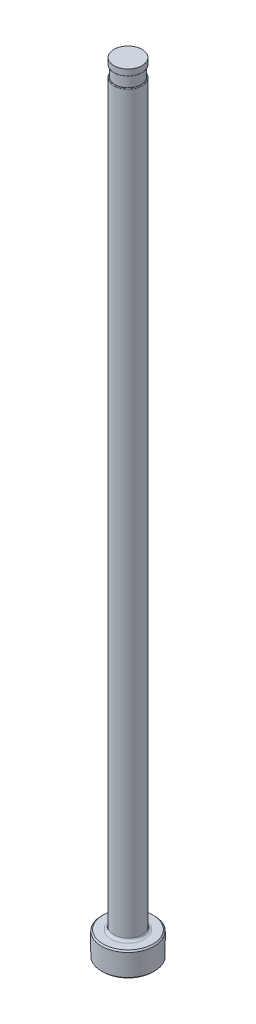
ISO-10303-21;
HEADER;
FILE_DESCRIPTION(('STEP AP214'),'2;1');
FILE_NAME('part.step','',(''),(''),'','','');
FILE_SCHEMA(('AUTOMOTIVE_DESIGN { 1 0 10303 214 1 1 1 1 }'));
ENDSEC;
DATA;
#1=APPLICATION_CONTEXT('core data for automotive mechanical design processes');
#2=APPLICATION_PROTOCOL_DEFINITION('international standard','automotive_design',2000,#1);
#3=PRODUCT_CONTEXT('',#1,'mechanical');
#4=PRODUCT('Part','Part','',(#3));
#5=PRODUCT_RELATED_PRODUCT_CATEGORY('part','',(#4));
#6=PRODUCT_DEFINITION_FORMATION('','',#4);
#7=PRODUCT_DEFINITION_CONTEXT('part definition',#1,'design');
#8=PRODUCT_DEFINITION('design','',#6,#7);
#9=PRODUCT_DEFINITION_SHAPE('','',#8);
#10=(LENGTH_UNIT() NAMED_UNIT(*) SI_UNIT(.MILLI.,.METRE.));
#11=(NAMED_UNIT(*) PLANE_ANGLE_UNIT() SI_UNIT($,.RADIAN.));
#12=(NAMED_UNIT(*) SI_UNIT($,.STERADIAN.) SOLID_ANGLE_UNIT());
#13=UNCERTAINTY_MEASURE_WITH_UNIT(LENGTH_MEASURE(1.E-05),#10,'distance_accuracy_value','');
#14=(GEOMETRIC_REPRESENTATION_CONTEXT(3) GLOBAL_UNCERTAINTY_ASSIGNED_CONTEXT((#13)) GLOBAL_UNIT_ASSIGNED_CONTEXT((#10,
#11,#12)) REPRESENTATION_CONTEXT('',''));
#15=CARTESIAN_POINT('',(0.,0.,0.));
#16=DIRECTION('',(0.,0.,1.));
#17=DIRECTION('',(1.,0.,0.));
#18=AXIS2_PLACEMENT_3D('',#15,#16,#17);
#19=CARTESIAN_POINT('',(-2.77748999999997,151.13,0.));
#20=DIRECTION('',(0.,1.,0.));
#21=DIRECTION('',(0.,0.,1.));
#22=AXIS2_PLACEMENT_3D('',#19,#20,#21);
#23=PLANE('',#22);
#24=CARTESIAN_POINT('',(0.,151.13,0.));
#25=DIRECTION('',(0.,1.,0.));
#26=DIRECTION('',(0.,0.,1.));
#27=AXIS2_PLACEMENT_3D('',#24,#25,#26);
#28=CIRCLE('',#27,2.63143999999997);
#29=CARTESIAN_POINT('',(0.,151.13,2.63143999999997));
#30=VERTEX_POINT('',#29);
#31=EDGE_CURVE('E11',#30,#30,#28,.F.);
#32=ORIENTED_EDGE('',*,*,#31,.T.);
#33=EDGE_LOOP('',(#32));
#34=FACE_BOUND('',#33,.T.);
#35=CARTESIAN_POINT('',(0.,151.13,0.));
#36=DIRECTION('',(0.,1.,0.));
#37=DIRECTION('',(0.,0.,1.));
#38=AXIS2_PLACEMENT_3D('',#35,#36,#37);
#39=CIRCLE('',#38,2.57428999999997);
#40=CARTESIAN_POINT('',(0.,151.13,2.57428999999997));
#41=VERTEX_POINT('',#40);
#42=EDGE_CURVE('E78',#41,#41,#39,.T.);
#43=ORIENTED_EDGE('',*,*,#42,.T.);
#44=EDGE_LOOP('',(#43));
#45=FACE_BOUND('',#44,.T.);
#46=ADVANCED_FACE('F36',(#34,#45),#23,.F.);
#47=CARTESIAN_POINT('',(0.,259.958771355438,0.));
#48=DIRECTION('',(0.,1.,0.));
#49=DIRECTION('',(0.,0.,1.));
#50=AXIS2_PLACEMENT_3D('',#47,#48,#49);
#51=CYLINDRICAL_SURFACE('',#50,2.77748999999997);
#52=DIRECTION('',(0.,1.,0.));
#53=VECTOR('',#52,1.);
#54=CARTESIAN_POINT('',(-2.57428999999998,259.958771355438,-1.04282390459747));
#55=LINE('',#54,#53);
#56=CARTESIAN_POINT('',(-2.57428999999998,148.971,-1.04282390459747));
#57=VERTEX_POINT('',#56);
#58=CARTESIAN_POINT('',(-2.57428999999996,86.614,-1.04282390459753));
#59=VERTEX_POINT('',#58);
#60=EDGE_CURVE('E73',#57,#59,#55,.F.);
#61=ORIENTED_EDGE('',*,*,#60,.F.);
#62=CARTESIAN_POINT('',(0.,148.971,0.));
#63=DIRECTION('',(0.,-1.,0.));
#64=DIRECTION('',(0.,0.,-1.));
#65=AXIS2_PLACEMENT_3D('',#62,#63,#64);
#66=CIRCLE('',#65,2.77748999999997);
#67=CARTESIAN_POINT('',(-2.57428999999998,148.971,1.04282390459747));
#68=VERTEX_POINT('',#67);
#69=EDGE_CURVE('E51',#57,#68,#66,.T.);
#70=ORIENTED_EDGE('',*,*,#69,.T.);
#71=DIRECTION('',(0.,1.,0.));
#72=VECTOR('',#71,1.);
#73=CARTESIAN_POINT('',(-2.57428999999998,259.958771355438,1.04282390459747));
#74=LINE('',#73,#72);
#75=CARTESIAN_POINT('',(-2.57428999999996,86.614,1.04282390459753));
#76=VERTEX_POINT('',#75);
#77=EDGE_CURVE('E84',#76,#68,#74,.T.);
#78=ORIENTED_EDGE('',*,*,#77,.F.);
#79=CARTESIAN_POINT('',(-2.57428999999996,86.614,-1.04282390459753));
#80=CARTESIAN_POINT('',(-2.57428787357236,86.5815852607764,-1.04282111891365));
#81=CARTESIAN_POINT('',(-2.57478701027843,86.5491850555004,-1.04159798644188));
#82=CARTESIAN_POINT('',(-2.57676382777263,86.4845964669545,-1.03670102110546));
#83=CARTESIAN_POINT('',(-2.57824163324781,86.4524081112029,-1.03302687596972));
#84=CARTESIAN_POINT('',(-2.58411032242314,86.356391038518,-1.01830472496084));
#85=CARTESIAN_POINT('',(-2.58993639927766,86.2931681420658,-1.00355696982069));
#86=CARTESIAN_POINT('',(-2.60484835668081,86.1701975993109,-0.964186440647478));
#87=CARTESIAN_POINT('',(-2.61393879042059,86.1104549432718,-0.939549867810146));
#88=CARTESIAN_POINT('',(-2.63439257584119,85.9964330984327,-0.880565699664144));
#89=CARTESIAN_POINT('',(-2.64575368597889,85.9421486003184,-0.846227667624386));
#90=CARTESIAN_POINT('',(-2.66906948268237,85.8423648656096,-0.769463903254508));
#91=CARTESIAN_POINT('',(-2.68099701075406,85.796654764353,-0.727304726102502));
#92=CARTESIAN_POINT('',(-2.70429977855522,85.7137106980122,-0.635186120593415));
#93=CARTESIAN_POINT('',(-2.71567511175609,85.676475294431,-0.585228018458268));
#94=CARTESIAN_POINT('',(-2.73569711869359,85.6140565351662,-0.482647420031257));
#95=CARTESIAN_POINT('',(-2.74447837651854,85.5882160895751,-0.430450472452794));
#96=CARTESIAN_POINT('',(-2.75929586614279,85.5457915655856,-0.322059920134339));
#97=CARTESIAN_POINT('',(-2.76533294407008,85.5292046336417,-0.265867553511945));
#98=CARTESIAN_POINT('',(-2.77376309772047,85.5062965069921,-0.153923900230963));
#99=CARTESIAN_POINT('',(-2.77631330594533,85.4995317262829,-0.0982747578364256));
#100=CARTESIAN_POINT('',(-2.77801884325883,85.4949917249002,0.0134385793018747));
#101=CARTESIAN_POINT('',(-2.77717458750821,85.497215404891,0.0695027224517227));
#102=CARTESIAN_POINT('',(-2.7722209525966,85.5104908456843,0.179520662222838));
#103=CARTESIAN_POINT('',(-2.76816343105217,85.5214024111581,0.233493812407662));
#104=CARTESIAN_POINT('',(-2.75726458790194,85.5516137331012,0.33873691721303));
#105=CARTESIAN_POINT('',(-2.7504233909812,85.5709131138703,0.390006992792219));
#106=CARTESIAN_POINT('',(-2.73459621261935,85.617579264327,0.488834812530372));
#107=CARTESIAN_POINT('',(-2.7255949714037,85.6450037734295,0.536362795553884));
#108=CARTESIAN_POINT('',(-2.70638807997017,85.7071227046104,0.626118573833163));
#109=CARTESIAN_POINT('',(-2.69618232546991,85.741817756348,0.668345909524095));
#110=CARTESIAN_POINT('',(-2.67522940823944,85.8187559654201,0.747895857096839));
#111=CARTESIAN_POINT('',(-2.66447542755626,85.8612077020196,0.785014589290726));
#112=CARTESIAN_POINT('',(-2.64380227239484,85.9516395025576,0.852053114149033));
#113=CARTESIAN_POINT('',(-2.63388340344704,85.9996215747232,0.881970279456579));
#114=CARTESIAN_POINT('',(-2.61524736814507,86.1028148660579,0.935839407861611));
#115=CARTESIAN_POINT('',(-2.60663744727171,86.1582867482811,0.959328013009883));
#116=CARTESIAN_POINT('',(-2.5921893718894,86.2724618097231,0.997711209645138));
#117=CARTESIAN_POINT('',(-2.58635078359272,86.3311644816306,1.01260714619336));
#118=CARTESIAN_POINT('',(-2.57955503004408,86.4275266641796,1.02975451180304));
#119=CARTESIAN_POINT('',(-2.57758531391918,86.4646676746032,1.03466198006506));
#120=CARTESIAN_POINT('',(-2.57495138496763,86.5392020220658,1.04119168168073));
#121=CARTESIAN_POINT('',(-2.57428434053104,86.5765946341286,1.04282104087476));
#122=CARTESIAN_POINT('',(-2.57428999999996,86.614,1.04282390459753));
#123=B_SPLINE_CURVE_WITH_KNOTS('',3,(#79,#80,#81,#82,#83,#84,#85,#86,#87,#88,#89,#90,#91,#92,
#93,#94,#95,#96,#97,#98,#99,#100,#101,#102,#103,#104,#105,#106,#107,#108,#109,#110,#111,#112,
#113,#114,#115,#116,#117,#118,#119,#120,#121,#122),.UNSPECIFIED.,.F.,.F.,(4,2,2,2,2,2,2,2,2,2,2,
2,2,2,2,2,2,2,2,2,2,4),(0.,0.0971880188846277,0.194388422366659,0.388960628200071,
0.583805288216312,0.778458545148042,0.967406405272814,1.1563221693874,1.33212671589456,
1.50787701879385,1.67541271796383,1.84292792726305,2.00779344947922,2.17265158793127,
2.33871056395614,2.5047839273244,2.67625192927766,2.84778239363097,3.02956415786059,
3.21131745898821,3.32371085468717,3.43585966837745),.UNSPECIFIED.);
#124=EDGE_CURVE('E81',#59,#76,#123,.T.);
#125=ORIENTED_EDGE('',*,*,#124,.F.);
#126=EDGE_LOOP('',(#61,#70,#78,#125));
#127=FACE_BOUND('',#126,.T.);
#128=CARTESIAN_POINT('',(0.,5.25779999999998,0.));
#129=DIRECTION('',(0.,1.,0.));
#130=DIRECTION('',(0.,0.,1.));
#131=AXIS2_PLACEMENT_3D('',#128,#129,#130);
#132=CIRCLE('',#131,2.77748999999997);
#133=CARTESIAN_POINT('',(0.,5.25779999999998,2.77748999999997));
#134=VERTEX_POINT('',#133);
#135=EDGE_CURVE('E116',#134,#134,#132,.T.);
#136=ORIENTED_EDGE('',*,*,#135,.T.);
#137=EDGE_LOOP('',(#136));
#138=FACE_BOUND('',#137,.T.);
#139=ADVANCED_FACE('F82',(#127,#138),#51,.T.);
#140=CARTESIAN_POINT('',(0.,0.,0.));
#141=DIRECTION('',(0.,-1.,0.));
#142=DIRECTION('',(0.,0.,-1.));
#143=AXIS2_PLACEMENT_3D('',#140,#141,#142);
#144=PLANE('',#143);
#145=CARTESIAN_POINT('',(0.,0.,0.));
#146=DIRECTION('',(0.,-1.,0.));
#147=DIRECTION('',(0.,0.,-1.));
#148=AXIS2_PLACEMENT_3D('',#145,#146,#147);
#149=CIRCLE('',#148,4.90220000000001);
#150=CARTESIAN_POINT('',(0.,0.,-4.90220000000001));
#151=VERTEX_POINT('',#150);
#152=EDGE_CURVE('E113',#151,#151,#149,.T.);
#153=ORIENTED_EDGE('',*,*,#152,.T.);
#154=EDGE_LOOP('',(#153));
#155=FACE_BOUND('',#154,.T.);
#156=ADVANCED_FACE('F192',(#155),#144,.T.);
#157=CARTESIAN_POINT('',(0.,259.958771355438,0.));
#158=DIRECTION('',(0.,1.,0.));
#159=DIRECTION('',(0.,0.,1.));
#160=AXIS2_PLACEMENT_3D('',#157,#158,#159);
#161=CYLINDRICAL_SURFACE('',#160,5.15619999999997);
#162=CARTESIAN_POINT('',(0.,4.49580000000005,0.));
#163=DIRECTION('',(0.,1.,0.));
#164=DIRECTION('',(0.,0.,1.));
#165=AXIS2_PLACEMENT_3D('',#162,#163,#164);
#166=CIRCLE('',#165,5.15619999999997);
#167=CARTESIAN_POINT('',(0.,4.49580000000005,5.15619999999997));
#168=VERTEX_POINT('',#167);
#169=EDGE_CURVE('E110',#168,#168,#166,.F.);
#170=ORIENTED_EDGE('',*,*,#169,.T.);
#171=EDGE_LOOP('',(#170));
#172=FACE_BOUND('',#171,.T.);
#173=CARTESIAN_POINT('',(0.,0.253999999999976,0.));
#174=DIRECTION('',(0.,-1.,0.));
#175=DIRECTION('',(0.,0.,-1.));
#176=AXIS2_PLACEMENT_3D('',#173,#174,#175);
#177=CIRCLE('',#176,5.15619999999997);
#178=CARTESIAN_POINT('',(0.,0.253999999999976,-5.15619999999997));
#179=VERTEX_POINT('',#178);
#180=EDGE_CURVE('E107',#179,#179,#177,.F.);
#181=ORIENTED_EDGE('',*,*,#180,.T.);
#182=EDGE_LOOP('',(#181));
#183=FACE_BOUND('',#182,.T.);
#184=ADVANCED_FACE('F195',(#172,#183),#161,.T.);
#185=CARTESIAN_POINT('',(-5.15619999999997,4.7498,0.));
#186=DIRECTION('',(0.,1.,0.));
#187=DIRECTION('',(0.,0.,1.));
#188=AXIS2_PLACEMENT_3D('',#185,#186,#187);
#189=PLANE('',#188);
#190=CARTESIAN_POINT('',(0.,4.7498,0.));
#191=DIRECTION('',(0.,1.,0.));
#192=DIRECTION('',(0.,0.,1.));
#193=AXIS2_PLACEMENT_3D('',#190,#191,#192);
#194=CIRCLE('',#193,3.28548999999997);
#195=CARTESIAN_POINT('',(0.,4.7498,3.28548999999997));
#196=VERTEX_POINT('',#195);
#197=EDGE_CURVE('E87',#196,#196,#194,.F.);
#198=ORIENTED_EDGE('',*,*,#197,.T.);
#199=EDGE_LOOP('',(#198));
#200=FACE_BOUND('',#199,.T.);
#201=CARTESIAN_POINT('',(0.,4.7498,0.));
#202=DIRECTION('',(0.,1.,0.));
#203=DIRECTION('',(0.,0.,1.));
#204=AXIS2_PLACEMENT_3D('',#201,#202,#203);
#205=CIRCLE('',#204,4.90220000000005);
#206=CARTESIAN_POINT('',(0.,4.7498,4.90220000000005));
#207=VERTEX_POINT('',#206);
#208=EDGE_CURVE('E104',#207,#207,#205,.T.);
#209=ORIENTED_EDGE('',*,*,#208,.T.);
#210=EDGE_LOOP('',(#209));
#211=FACE_BOUND('',#210,.T.);
#212=ADVANCED_FACE('F190',(#200,#211),#189,.T.);
#213=CARTESIAN_POINT('',(0.,4.74980000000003,0.));
#214=DIRECTION('',(0.,-1.,0.));
#215=DIRECTION('',(0.,0.,-1.));
#216=AXIS2_PLACEMENT_3D('',#213,#214,#215);
#217=CONICAL_SURFACE('',#216,4.90220000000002,0.785398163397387);
#218=ORIENTED_EDGE('',*,*,#169,.F.);
#219=EDGE_LOOP('',(#218));
#220=FACE_BOUND('',#219,.T.);
#221=ORIENTED_EDGE('',*,*,#208,.F.);
#222=EDGE_LOOP('',(#221));
#223=FACE_BOUND('',#222,.T.);
#224=ADVANCED_FACE('F186',(#220,#223),#217,.T.);
#225=CARTESIAN_POINT('',(0.,0.253999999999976,0.));
#226=DIRECTION('',(0.,1.,0.));
#227=DIRECTION('',(0.,0.,1.));
#228=AXIS2_PLACEMENT_3D('',#225,#226,#227);
#229=CONICAL_SURFACE('',#228,5.15619999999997,0.785398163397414);
#230=ORIENTED_EDGE('',*,*,#152,.F.);
#231=EDGE_LOOP('',(#230));
#232=FACE_BOUND('',#231,.T.);
#233=ORIENTED_EDGE('',*,*,#180,.F.);
#234=EDGE_LOOP('',(#233));
#235=FACE_BOUND('',#234,.T.);
#236=ADVANCED_FACE('F182',(#232,#235),#229,.T.);
#237=CARTESIAN_POINT('',(0.,5.25779999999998,0.));
#238=DIRECTION('',(0.,1.,0.));
#239=DIRECTION('',(0.,0.,1.));
#240=AXIS2_PLACEMENT_3D('',#237,#238,#239);
#241=TOROIDAL_SURFACE('',#240,3.28548999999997,0.508);
#242=ORIENTED_EDGE('',*,*,#197,.F.);
#243=EDGE_LOOP('',(#242));
#244=FACE_BOUND('',#243,.T.);
#245=ORIENTED_EDGE('',*,*,#135,.F.);
#246=EDGE_LOOP('',(#245));
#247=FACE_BOUND('',#246,.T.);
#248=ADVANCED_FACE('F147',(#244,#247),#241,.F.);
#249=CARTESIAN_POINT('',(-2.77748999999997,149.098,0.));
#250=DIRECTION('',(0.,-1.,0.));
#251=DIRECTION('',(0.,0.,-1.));
#252=AXIS2_PLACEMENT_3D('',#249,#250,#251);
#253=PLANE('',#252);
#254=DIRECTION('',(0.,0.,1.));
#255=VECTOR('',#254,1.);
#256=CARTESIAN_POINT('',(-2.57428999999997,149.098,0.));
#257=LINE('',#256,#255);
#258=CARTESIAN_POINT('',(-2.57428999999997,149.098,0.));
#259=VERTEX_POINT('',#258);
#260=CARTESIAN_POINT('',(-2.57428999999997,149.098,0.630974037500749));
#261=VERTEX_POINT('',#260);
#262=EDGE_CURVE('E90',#259,#261,#257,.T.);
#263=ORIENTED_EDGE('',*,*,#262,.T.);
#264=CARTESIAN_POINT('',(0.,149.098,0.));
#265=DIRECTION('',(0.,-1.,0.));
#266=DIRECTION('',(0.,0.,-1.));
#267=AXIS2_PLACEMENT_3D('',#264,#265,#266);
#268=CIRCLE('',#267,2.65048999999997);
#269=CARTESIAN_POINT('',(-2.57428999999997,149.098,-0.630974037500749));
#270=VERTEX_POINT('',#269);
#271=EDGE_CURVE('E86',#261,#270,#268,.F.);
#272=ORIENTED_EDGE('',*,*,#271,.T.);
#273=EDGE_CURVE('E79',#270,#259,#257,.T.);
#274=ORIENTED_EDGE('',*,*,#273,.T.);
#275=CARTESIAN_POINT('',(0.,149.098,0.));
#276=DIRECTION('',(0.,1.,0.));
#277=DIRECTION('',(0.,0.,1.));
#278=AXIS2_PLACEMENT_3D('',#275,#276,#277);
#279=CIRCLE('',#278,2.57428999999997);
#280=EDGE_CURVE('E101',#259,#259,#279,.T.);
#281=ORIENTED_EDGE('',*,*,#280,.F.);
#282=EDGE_LOOP('',(#263,#272,#274,#281));
#283=FACE_BOUND('',#282,.T.);
#284=ADVANCED_FACE('F144',(#283),#253,.F.);
#285=CARTESIAN_POINT('',(0.,153.448281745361,0.));
#286=DIRECTION('',(0.,1.,0.));
#287=DIRECTION('',(0.,0.,1.));
#288=AXIS2_PLACEMENT_3D('',#285,#286,#287);
#289=CYLINDRICAL_SURFACE('',#288,2.57428999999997);
#290=ORIENTED_EDGE('',*,*,#42,.F.);
#291=EDGE_LOOP('',(#290));
#292=FACE_BOUND('',#291,.T.);
#293=ORIENTED_EDGE('',*,*,#280,.T.);
#294=EDGE_LOOP('',(#293));
#295=FACE_BOUND('',#294,.T.);
#296=ADVANCED_FACE('F141',(#292,#295),#289,.T.);
#297=CARTESIAN_POINT('',(-2.57428999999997,150.114,-5.15619999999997));
#298=DIRECTION('',(1.,0.,0.));
#299=DIRECTION('',(0.,1.,0.));
#300=AXIS2_PLACEMENT_3D('',#297,#298,#299);
#301=PLANE('',#300);
#302=ORIENTED_EDGE('',*,*,#273,.F.);
#303=CARTESIAN_POINT('',(-2.57428999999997,149.098,-0.630974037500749));
#304=CARTESIAN_POINT('',(-2.57428999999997,149.097988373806,-0.652186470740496));
#305=CARTESIAN_POINT('',(-2.57428999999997,149.097697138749,-0.673409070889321));
#306=CARTESIAN_POINT('',(-2.57428999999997,149.096309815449,-0.715909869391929));
#307=CARTESIAN_POINT('',(-2.57428999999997,149.095210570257,-0.73718795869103));
#308=CARTESIAN_POINT('',(-2.57428999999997,149.091955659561,-0.779696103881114));
#309=CARTESIAN_POINT('',(-2.57428999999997,149.089798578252,-0.800926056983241));
#310=CARTESIAN_POINT('',(-2.57428999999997,149.084053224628,-0.8431716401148));
#311=CARTESIAN_POINT('',(-2.57428999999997,149.080467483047,-0.864187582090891));
#312=CARTESIAN_POINT('',(-2.57428999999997,149.07367465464,-0.894737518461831));
#313=CARTESIAN_POINT('',(-2.57428999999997,149.071275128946,-0.904450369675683));
#314=CARTESIAN_POINT('',(-2.57428999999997,149.065899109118,-0.923745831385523));
#315=CARTESIAN_POINT('',(-2.57428999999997,149.062921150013,-0.933328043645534));
#316=CARTESIAN_POINT('',(-2.57428999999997,149.055733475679,-0.95367532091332));
#317=CARTESIAN_POINT('',(-2.57428999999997,149.051405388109,-0.964399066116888));
#318=CARTESIAN_POINT('',(-2.57428999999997,149.041429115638,-0.985202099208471));
#319=CARTESIAN_POINT('',(-2.57428999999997,149.035787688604,-0.995284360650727));
#320=CARTESIAN_POINT('',(-2.57428999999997,149.026621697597,-1.00826014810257));
#321=CARTESIAN_POINT('',(-2.57428999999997,149.023943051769,-1.0117461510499));
#322=CARTESIAN_POINT('',(-2.57428999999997,149.018228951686,-1.01843326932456));
#323=CARTESIAN_POINT('',(-2.57428999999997,149.015192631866,-1.02163365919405));
#324=CARTESIAN_POINT('',(-2.57428999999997,149.008665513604,-1.02764631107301));
#325=CARTESIAN_POINT('',(-2.57428999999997,149.005168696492,-1.03045218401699));
#326=CARTESIAN_POINT('',(-2.57428999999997,148.997739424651,-1.03537629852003));
#327=CARTESIAN_POINT('',(-2.57428999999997,148.993810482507,-1.03749960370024));
#328=CARTESIAN_POINT('',(-2.57428999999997,148.986740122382,-1.04030637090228));
#329=CARTESIAN_POINT('',(-2.57428999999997,148.98369508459,-1.04122798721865));
#330=CARTESIAN_POINT('',(-2.57428999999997,148.977439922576,-1.04249667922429));
#331=CARTESIAN_POINT('',(-2.57428999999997,148.974227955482,-1.04283449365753));
#332=CARTESIAN_POINT('',(-2.57428999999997,148.971,-1.04282390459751));
#333=B_SPLINE_CURVE_WITH_KNOTS('',3,(#303,#304,#305,#306,#307,#308,#309,#310,#311,#312,#313,
#314,#315,#316,#317,#318,#319,#320,#321,#322,#323,#324,#325,#326,#327,#328,#329,#330,#331,#332),
.UNSPECIFIED.,.F.,.F.,(4,2,2,2,2,2,2,2,2,2,2,2,2,2,4),(0.,0.0636515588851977,0.1275531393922,
0.19154048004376,0.255414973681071,0.285417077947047,0.315496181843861,0.350142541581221,
0.384614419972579,0.397785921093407,0.410989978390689,0.424387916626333,0.437684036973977,
0.447175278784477,0.456815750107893),.UNSPECIFIED.);
#334=EDGE_CURVE('E59',#270,#57,#333,.T.);
#335=ORIENTED_EDGE('',*,*,#334,.T.);
#336=ORIENTED_EDGE('',*,*,#60,.T.);
#337=DIRECTION('',(0.,0.,1.));
#338=VECTOR('',#337,1.);
#339=CARTESIAN_POINT('',(-2.57428999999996,86.614,-5.15619999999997));
#340=LINE('',#339,#338);
#341=EDGE_CURVE('E77',#59,#76,#340,.T.);
#342=ORIENTED_EDGE('',*,*,#341,.T.);
#343=ORIENTED_EDGE('',*,*,#77,.T.);
#344=CARTESIAN_POINT('',(-2.57428999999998,148.971,1.04282390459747));
#345=CARTESIAN_POINT('',(-2.57428999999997,148.973997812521,1.04283236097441));
#346=CARTESIAN_POINT('',(-2.57428999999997,148.976984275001,1.04254163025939));
#347=CARTESIAN_POINT('',(-2.57428999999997,148.98282304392,1.04144104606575));
#348=CARTESIAN_POINT('',(-2.57428999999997,148.985676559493,1.04063771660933));
#349=CARTESIAN_POINT('',(-2.57428999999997,148.991880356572,1.03834208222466));
#350=CARTESIAN_POINT('',(-2.57428999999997,148.995185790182,1.0367307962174));
#351=CARTESIAN_POINT('',(-2.57428999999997,149.001505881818,1.03299596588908));
#352=CARTESIAN_POINT('',(-2.57428999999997,149.004518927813,1.03086978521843));
#353=CARTESIAN_POINT('',(-2.57428999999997,149.012062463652,1.02479237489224));
#354=CARTESIAN_POINT('',(-2.57428999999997,149.016345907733,1.02053793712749));
#355=CARTESIAN_POINT('',(-2.57428999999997,149.024251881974,1.01146538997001));
#356=CARTESIAN_POINT('',(-2.57428999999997,149.027873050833,1.00664615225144));
#357=CARTESIAN_POINT('',(-2.57428999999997,149.038266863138,0.991217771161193));
#358=CARTESIAN_POINT('',(-2.57428999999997,149.044166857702,0.980028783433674));
#359=CARTESIAN_POINT('',(-2.57428999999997,149.054501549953,0.957006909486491));
#360=CARTESIAN_POINT('',(-2.57428999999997,149.058931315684,0.945172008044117));
#361=CARTESIAN_POINT('',(-2.57428999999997,149.069366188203,0.913140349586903));
#362=CARTESIAN_POINT('',(-2.57428999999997,149.074443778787,0.89264434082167));
#363=CARTESIAN_POINT('',(-2.57428999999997,149.082753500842,0.851271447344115));
#364=CARTESIAN_POINT('',(-2.57428999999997,149.085981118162,0.830393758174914));
#365=CARTESIAN_POINT('',(-2.57428999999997,149.093717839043,0.767434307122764));
#366=CARTESIAN_POINT('',(-2.57428999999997,149.096259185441,0.725112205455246));
#367=CARTESIAN_POINT('',(-2.57428999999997,149.097575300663,0.674152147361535));
#368=CARTESIAN_POINT('',(-2.57428999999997,149.097738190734,0.665497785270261));
#369=CARTESIAN_POINT('',(-2.57428999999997,149.097950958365,0.648220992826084));
#370=CARTESIAN_POINT('',(-2.57428999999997,149.09800126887,0.639598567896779));
#371=CARTESIAN_POINT('',(-2.57428999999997,149.098,0.63097403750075));
#372=B_SPLINE_CURVE_WITH_KNOTS('',3,(#344,#345,#346,#347,#348,#349,#350,#351,#352,#353,#354,
#355,#356,#357,#358,#359,#360,#361,#362,#363,#364,#365,#366,#367,#368,#369,#370,#371),
.UNSPECIFIED.,.F.,.F.,(4,2,2,2,2,2,2,2,2,2,2,2,2,4),(0.,0.00896107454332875,0.017810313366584,
0.0287804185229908,0.0398079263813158,0.0578172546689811,0.0758631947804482,0.113599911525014,
0.151461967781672,0.214643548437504,0.277978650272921,0.404912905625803,0.430882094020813,
0.456751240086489),.UNSPECIFIED.);
#373=EDGE_CURVE('E172',#68,#261,#372,.T.);
#374=ORIENTED_EDGE('',*,*,#373,.T.);
#375=ORIENTED_EDGE('',*,*,#262,.F.);
#376=EDGE_LOOP('',(#302,#335,#336,#342,#343,#374,#375));
#377=FACE_BOUND('',#376,.T.);
#378=ADVANCED_FACE('F75',(#377),#301,.F.);
#379=CARTESIAN_POINT('',(-5.74928999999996,86.614,-5.15619999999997));
#380=DIRECTION('',(0.,0.,1.));
#381=DIRECTION('',(1.,0.,0.));
#382=AXIS2_PLACEMENT_3D('',#379,#380,#381);
#383=CYLINDRICAL_SURFACE('',#382,3.175);
#384=ORIENTED_EDGE('',*,*,#341,.F.);
#385=ORIENTED_EDGE('',*,*,#124,.T.);
#386=EDGE_LOOP('',(#384,#385));
#387=FACE_BOUND('',#386,.T.);
#388=ADVANCED_FACE('F89',(#387),#383,.F.);
#389=CARTESIAN_POINT('',(0.,152.687735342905,0.));
#390=DIRECTION('',(0.,1.,0.));
#391=DIRECTION('',(0.,0.,1.));
#392=AXIS2_PLACEMENT_3D('',#389,#390,#391);
#393=CYLINDRICAL_SURFACE('',#392,2.75843999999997);
#394=CARTESIAN_POINT('',(0.,151.257,0.));
#395=DIRECTION('',(0.,1.,0.));
#396=DIRECTION('',(0.,0.,1.));
#397=AXIS2_PLACEMENT_3D('',#394,#395,#396);
#398=CIRCLE('',#397,2.75843999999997);
#399=CARTESIAN_POINT('',(0.,151.257,2.75843999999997));
#400=VERTEX_POINT('',#399);
#401=EDGE_CURVE('E44',#400,#400,#398,.T.);
#402=ORIENTED_EDGE('',*,*,#401,.T.);
#403=EDGE_LOOP('',(#402));
#404=FACE_BOUND('',#403,.T.);
#405=CARTESIAN_POINT('',(0.,152.4,0.));
#406=DIRECTION('',(0.,1.,0.));
#407=DIRECTION('',(0.,0.,1.));
#408=AXIS2_PLACEMENT_3D('',#405,#406,#407);
#409=CIRCLE('',#408,2.75843999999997);
#410=CARTESIAN_POINT('',(0.,152.4,2.75843999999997));
#411=VERTEX_POINT('',#410);
#412=EDGE_CURVE('E91',#411,#411,#409,.T.);
#413=ORIENTED_EDGE('',*,*,#412,.F.);
#414=EDGE_LOOP('',(#413));
#415=FACE_BOUND('',#414,.T.);
#416=ADVANCED_FACE('F135',(#404,#415),#393,.T.);
#417=CARTESIAN_POINT('',(-2.77748999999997,152.4,0.));
#418=DIRECTION('',(0.,1.,0.));
#419=DIRECTION('',(0.,0.,1.));
#420=AXIS2_PLACEMENT_3D('',#417,#418,#419);
#421=PLANE('',#420);
#422=ORIENTED_EDGE('',*,*,#412,.T.);
#423=EDGE_LOOP('',(#422));
#424=FACE_BOUND('',#423,.T.);
#425=ADVANCED_FACE('F149',(#424),#421,.T.);
#426=CARTESIAN_POINT('',(0.,148.971,0.));
#427=DIRECTION('',(0.,-1.,0.));
#428=DIRECTION('',(0.,0.,-1.));
#429=AXIS2_PLACEMENT_3D('',#426,#427,#428);
#430=TOROIDAL_SURFACE('',#429,2.65048999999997,0.127);
#431=ORIENTED_EDGE('',*,*,#373,.F.);
#432=ORIENTED_EDGE('',*,*,#69,.F.);
#433=ORIENTED_EDGE('',*,*,#334,.F.);
#434=ORIENTED_EDGE('',*,*,#271,.F.);
#435=EDGE_LOOP('',(#431,#432,#433,#434));
#436=FACE_BOUND('',#435,.T.);
#437=ADVANCED_FACE('F151',(#436),#430,.T.);
#438=CARTESIAN_POINT('',(0.,151.257,0.));
#439=DIRECTION('',(0.,1.,0.));
#440=DIRECTION('',(0.,0.,1.));
#441=AXIS2_PLACEMENT_3D('',#438,#439,#440);
#442=TOROIDAL_SURFACE('',#441,2.63143999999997,0.127);
#443=ORIENTED_EDGE('',*,*,#31,.F.);
#444=EDGE_LOOP('',(#443));
#445=FACE_BOUND('',#444,.T.);
#446=ORIENTED_EDGE('',*,*,#401,.F.);
#447=EDGE_LOOP('',(#446));
#448=FACE_BOUND('',#447,.T.);
#449=ADVANCED_FACE('F38',(#445,#448),#442,.T.);
#450=CLOSED_SHELL('',(#46,#139,#156,#184,#212,#224,#236,#248,#284,#296,#378,#388,#416,#425,#437,#449));
#451=MANIFOLD_SOLID_BREP('B2',#450);
#452=ADVANCED_BREP_SHAPE_REPRESENTATION('',(#18,#451),#14);
#453=SHAPE_DEFINITION_REPRESENTATION(#9,#452);
ENDSEC;
END-ISO-10303-21;
